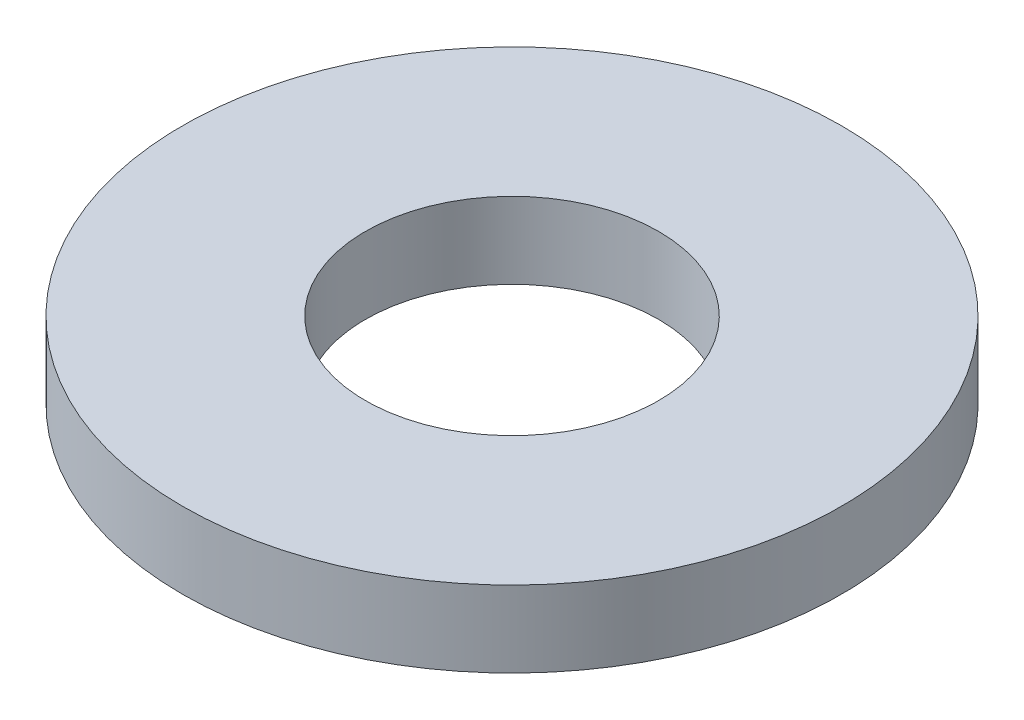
ISO-10303-21;
HEADER;
FILE_DESCRIPTION(('STEP AP214'),'2;1');
FILE_NAME('part.step','',(''),(''),'','','');
FILE_SCHEMA(('AUTOMOTIVE_DESIGN { 1 0 10303 214 1 1 1 1 }'));
ENDSEC;
DATA;
#1=APPLICATION_CONTEXT('core data for automotive mechanical design processes');
#2=APPLICATION_PROTOCOL_DEFINITION('international standard','automotive_design',2000,#1);
#3=PRODUCT_CONTEXT('',#1,'mechanical');
#4=PRODUCT('Part','Part','',(#3));
#5=PRODUCT_RELATED_PRODUCT_CATEGORY('part','',(#4));
#6=PRODUCT_DEFINITION_FORMATION('','',#4);
#7=PRODUCT_DEFINITION_CONTEXT('part definition',#1,'design');
#8=PRODUCT_DEFINITION('design','',#6,#7);
#9=PRODUCT_DEFINITION_SHAPE('','',#8);
#10=(LENGTH_UNIT() NAMED_UNIT(*) SI_UNIT(.MILLI.,.METRE.));
#11=(NAMED_UNIT(*) PLANE_ANGLE_UNIT() SI_UNIT($,.RADIAN.));
#12=(NAMED_UNIT(*) SI_UNIT($,.STERADIAN.) SOLID_ANGLE_UNIT());
#13=UNCERTAINTY_MEASURE_WITH_UNIT(LENGTH_MEASURE(1.E-05),#10,'distance_accuracy_value','');
#14=(GEOMETRIC_REPRESENTATION_CONTEXT(3) GLOBAL_UNCERTAINTY_ASSIGNED_CONTEXT((#13)) GLOBAL_UNIT_ASSIGNED_CONTEXT((#10,
#11,#12)) REPRESENTATION_CONTEXT('',''));
#15=CARTESIAN_POINT('',(0.,0.,0.));
#16=DIRECTION('',(0.,0.,1.));
#17=DIRECTION('',(1.,0.,0.));
#18=AXIS2_PLACEMENT_3D('',#15,#16,#17);
#19=CARTESIAN_POINT('',(0.,1.651,0.));
#20=DIRECTION('',(0.,1.,0.));
#21=DIRECTION('',(0.,0.,1.));
#22=AXIS2_PLACEMENT_3D('',#19,#20,#21);
#23=PLANE('',#22);
#24=CARTESIAN_POINT('',(0.,1.651,0.));
#25=DIRECTION('',(0.,1.,0.));
#26=DIRECTION('',(0.,0.,1.));
#27=AXIS2_PLACEMENT_3D('',#24,#25,#26);
#28=CIRCLE('',#27,7.1374);
#29=CARTESIAN_POINT('',(0.,1.651,-7.1374));
#30=VERTEX_POINT('',#29);
#31=EDGE_CURVE('E10',#30,#30,#28,.T.);
#32=ORIENTED_EDGE('',*,*,#31,.T.);
#33=EDGE_LOOP('',(#32));
#34=FACE_BOUND('',#33,.T.);
#35=CARTESIAN_POINT('',(0.,1.651,0.));
#36=DIRECTION('',(0.,1.,0.));
#37=DIRECTION('',(0.,0.,1.));
#38=AXIS2_PLACEMENT_3D('',#35,#36,#37);
#39=CIRCLE('',#38,3.175);
#40=CARTESIAN_POINT('',(0.,1.651,-3.175));
#41=VERTEX_POINT('',#40);
#42=EDGE_CURVE('E46',#41,#41,#39,.T.);
#43=ORIENTED_EDGE('',*,*,#42,.F.);
#44=EDGE_LOOP('',(#43));
#45=FACE_BOUND('',#44,.T.);
#46=ADVANCED_FACE('F33',(#34,#45),#23,.T.);
#47=CARTESIAN_POINT('',(0.,0.,0.));
#48=DIRECTION('',(0.,1.,0.));
#49=DIRECTION('',(0.,0.,1.));
#50=AXIS2_PLACEMENT_3D('',#47,#48,#49);
#51=PLANE('',#50);
#52=CARTESIAN_POINT('',(0.,0.,0.));
#53=DIRECTION('',(0.,1.,0.));
#54=DIRECTION('',(0.,0.,1.));
#55=AXIS2_PLACEMENT_3D('',#52,#53,#54);
#56=CIRCLE('',#55,7.1374);
#57=CARTESIAN_POINT('',(0.,0.,-7.1374));
#58=VERTEX_POINT('',#57);
#59=EDGE_CURVE('E37',#58,#58,#56,.T.);
#60=ORIENTED_EDGE('',*,*,#59,.F.);
#61=EDGE_LOOP('',(#60));
#62=FACE_BOUND('',#61,.T.);
#63=CARTESIAN_POINT('',(0.,0.,0.));
#64=DIRECTION('',(0.,1.,0.));
#65=DIRECTION('',(0.,0.,1.));
#66=AXIS2_PLACEMENT_3D('',#63,#64,#65);
#67=CIRCLE('',#66,3.175);
#68=CARTESIAN_POINT('',(0.,0.,-3.175));
#69=VERTEX_POINT('',#68);
#70=EDGE_CURVE('E48',#69,#69,#67,.T.);
#71=ORIENTED_EDGE('',*,*,#70,.T.);
#72=EDGE_LOOP('',(#71));
#73=FACE_BOUND('',#72,.T.);
#74=ADVANCED_FACE('F58',(#62,#73),#51,.F.);
#75=CARTESIAN_POINT('',(0.,1.651,0.));
#76=DIRECTION('',(0.,-1.,0.));
#77=DIRECTION('',(0.,0.,-1.));
#78=AXIS2_PLACEMENT_3D('',#75,#76,#77);
#79=CYLINDRICAL_SURFACE('',#78,7.1374);
#80=CARTESIAN_POINT('',(0.,1.651,-7.1374));
#81=CARTESIAN_POINT('',(0.,1.63380208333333,-7.1374));
#82=CARTESIAN_POINT('',(0.,1.61660416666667,-7.1374));
#83=CARTESIAN_POINT('',(0.,1.58220833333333,-7.1374));
#84=CARTESIAN_POINT('',(0.,1.56501041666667,-7.1374));
#85=CARTESIAN_POINT('',(0.,1.53061458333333,-7.1374));
#86=CARTESIAN_POINT('',(0.,1.51341666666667,-7.1374));
#87=CARTESIAN_POINT('',(0.,1.47902083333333,-7.1374));
#88=CARTESIAN_POINT('',(0.,1.46182291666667,-7.1374));
#89=CARTESIAN_POINT('',(0.,1.42742708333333,-7.1374));
#90=CARTESIAN_POINT('',(0.,1.41022916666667,-7.1374));
#91=CARTESIAN_POINT('',(0.,1.37583333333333,-7.1374));
#92=CARTESIAN_POINT('',(0.,1.35863541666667,-7.1374));
#93=CARTESIAN_POINT('',(0.,1.32423958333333,-7.1374));
#94=CARTESIAN_POINT('',(0.,1.30704166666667,-7.1374));
#95=CARTESIAN_POINT('',(0.,1.27264583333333,-7.1374));
#96=CARTESIAN_POINT('',(0.,1.25544791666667,-7.1374));
#97=CARTESIAN_POINT('',(0.,1.22105208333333,-7.1374));
#98=CARTESIAN_POINT('',(0.,1.20385416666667,-7.1374));
#99=CARTESIAN_POINT('',(0.,1.16945833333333,-7.1374));
#100=CARTESIAN_POINT('',(0.,1.15226041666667,-7.1374));
#101=CARTESIAN_POINT('',(0.,1.11786458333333,-7.1374));
#102=CARTESIAN_POINT('',(0.,1.10066666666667,-7.1374));
#103=CARTESIAN_POINT('',(0.,1.06627083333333,-7.1374));
#104=CARTESIAN_POINT('',(0.,1.04907291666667,-7.1374));
#105=CARTESIAN_POINT('',(0.,1.01467708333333,-7.1374));
#106=CARTESIAN_POINT('',(0.,0.997479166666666,-7.1374));
#107=CARTESIAN_POINT('',(0.,0.963083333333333,-7.1374));
#108=CARTESIAN_POINT('',(0.,0.945885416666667,-7.1374));
#109=CARTESIAN_POINT('',(0.,0.911489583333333,-7.1374));
#110=CARTESIAN_POINT('',(0.,0.894291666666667,-7.1374));
#111=CARTESIAN_POINT('',(0.,0.859895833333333,-7.1374));
#112=CARTESIAN_POINT('',(0.,0.842697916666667,-7.1374));
#113=CARTESIAN_POINT('',(0.,0.808302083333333,-7.1374));
#114=CARTESIAN_POINT('',(0.,0.791104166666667,-7.1374));
#115=CARTESIAN_POINT('',(0.,0.756708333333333,-7.1374));
#116=CARTESIAN_POINT('',(0.,0.739510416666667,-7.1374));
#117=CARTESIAN_POINT('',(0.,0.705114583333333,-7.1374));
#118=CARTESIAN_POINT('',(0.,0.687916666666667,-7.1374));
#119=CARTESIAN_POINT('',(0.,0.653520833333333,-7.1374));
#120=CARTESIAN_POINT('',(0.,0.636322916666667,-7.1374));
#121=CARTESIAN_POINT('',(0.,0.601927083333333,-7.1374));
#122=CARTESIAN_POINT('',(0.,0.584729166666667,-7.1374));
#123=CARTESIAN_POINT('',(0.,0.550333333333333,-7.1374));
#124=CARTESIAN_POINT('',(0.,0.533135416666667,-7.1374));
#125=CARTESIAN_POINT('',(0.,0.498739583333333,-7.1374));
#126=CARTESIAN_POINT('',(0.,0.481541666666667,-7.1374));
#127=CARTESIAN_POINT('',(0.,0.447145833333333,-7.1374));
#128=CARTESIAN_POINT('',(0.,0.429947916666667,-7.1374));
#129=CARTESIAN_POINT('',(0.,0.395552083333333,-7.1374));
#130=CARTESIAN_POINT('',(0.,0.378354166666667,-7.1374));
#131=CARTESIAN_POINT('',(0.,0.343958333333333,-7.1374));
#132=CARTESIAN_POINT('',(0.,0.326760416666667,-7.1374));
#133=CARTESIAN_POINT('',(0.,0.292364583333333,-7.1374));
#134=CARTESIAN_POINT('',(0.,0.275166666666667,-7.1374));
#135=CARTESIAN_POINT('',(0.,0.240770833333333,-7.1374));
#136=CARTESIAN_POINT('',(0.,0.223572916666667,-7.1374));
#137=CARTESIAN_POINT('',(0.,0.189177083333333,-7.1374));
#138=CARTESIAN_POINT('',(0.,0.171979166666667,-7.1374));
#139=CARTESIAN_POINT('',(0.,0.137583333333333,-7.1374));
#140=CARTESIAN_POINT('',(0.,0.120385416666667,-7.1374));
#141=CARTESIAN_POINT('',(0.,0.0859895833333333,-7.1374));
#142=CARTESIAN_POINT('',(0.,0.0687916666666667,-7.1374));
#143=CARTESIAN_POINT('',(0.,0.0343958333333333,-7.1374));
#144=CARTESIAN_POINT('',(0.,0.0171979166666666,-7.1374));
#145=CARTESIAN_POINT('',(0.,0.,-7.1374));
#146=B_SPLINE_CURVE_WITH_KNOTS('',3,(#80,#81,#82,#83,#84,#85,#86,#87,#88,#89,#90,#91,#92,#93,
#94,#95,#96,#97,#98,#99,#100,#101,#102,#103,#104,#105,#106,#107,#108,#109,#110,#111,#112,#113,
#114,#115,#116,#117,#118,#119,#120,#121,#122,#123,#124,#125,#126,#127,#128,#129,#130,#131,#132,
#133,#134,#135,#136,#137,#138,#139,#140,#141,#142,#143,#144,#145),.UNSPECIFIED.,.F.,.F.,(4,2,2,
2,2,2,2,2,2,2,2,2,2,2,2,2,2,2,2,2,2,2,2,2,2,2,2,2,2,2,2,2,4),(0.,0.05159375,0.1031875,
0.15478125,0.206375,0.25796875,0.3095625,0.36115625,0.41275,0.46434375,0.5159375,0.56753125,
0.619125,0.67071875,0.7223125,0.77390625,0.8255,0.87709375,0.9286875,0.98028125,1.031875,
1.08346875,1.1350625,1.18665625,1.23825,1.28984375,1.3414375,1.39303125,1.444625,1.49621875,
1.5478125,1.59940625,1.651),.UNSPECIFIED.);
#147=EDGE_CURVE('BSEAM35',#30,#58,#146,.T.);
#148=ORIENTED_EDGE('',*,*,#31,.F.);
#149=ORIENTED_EDGE('',*,*,#59,.T.);
#150=ORIENTED_EDGE('',*,*,#147,.T.);
#151=ORIENTED_EDGE('',*,*,#147,.F.);
#152=EDGE_LOOP('',(#148,#150,#149,#151));
#153=FACE_BOUND('',#152,.T.);
#154=ADVANCED_FACE('F35',(#153),#79,.T.);
#155=CARTESIAN_POINT('',(0.,1.651,0.));
#156=DIRECTION('',(0.,-1.,0.));
#157=DIRECTION('',(0.,0.,-1.));
#158=AXIS2_PLACEMENT_3D('',#155,#156,#157);
#159=CYLINDRICAL_SURFACE('',#158,3.175);
#160=CARTESIAN_POINT('',(0.,1.651,-3.175));
#161=CARTESIAN_POINT('',(0.,1.63380208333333,-3.175));
#162=CARTESIAN_POINT('',(0.,1.61660416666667,-3.175));
#163=CARTESIAN_POINT('',(0.,1.58220833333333,-3.175));
#164=CARTESIAN_POINT('',(0.,1.56501041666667,-3.175));
#165=CARTESIAN_POINT('',(0.,1.53061458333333,-3.175));
#166=CARTESIAN_POINT('',(0.,1.51341666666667,-3.175));
#167=CARTESIAN_POINT('',(0.,1.47902083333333,-3.175));
#168=CARTESIAN_POINT('',(0.,1.46182291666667,-3.175));
#169=CARTESIAN_POINT('',(0.,1.42742708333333,-3.175));
#170=CARTESIAN_POINT('',(0.,1.41022916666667,-3.175));
#171=CARTESIAN_POINT('',(0.,1.37583333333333,-3.175));
#172=CARTESIAN_POINT('',(0.,1.35863541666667,-3.175));
#173=CARTESIAN_POINT('',(0.,1.32423958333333,-3.175));
#174=CARTESIAN_POINT('',(0.,1.30704166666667,-3.175));
#175=CARTESIAN_POINT('',(0.,1.27264583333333,-3.175));
#176=CARTESIAN_POINT('',(0.,1.25544791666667,-3.175));
#177=CARTESIAN_POINT('',(0.,1.22105208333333,-3.175));
#178=CARTESIAN_POINT('',(0.,1.20385416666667,-3.175));
#179=CARTESIAN_POINT('',(0.,1.16945833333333,-3.175));
#180=CARTESIAN_POINT('',(0.,1.15226041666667,-3.175));
#181=CARTESIAN_POINT('',(0.,1.11786458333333,-3.175));
#182=CARTESIAN_POINT('',(0.,1.10066666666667,-3.175));
#183=CARTESIAN_POINT('',(0.,1.06627083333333,-3.175));
#184=CARTESIAN_POINT('',(0.,1.04907291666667,-3.175));
#185=CARTESIAN_POINT('',(0.,1.01467708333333,-3.175));
#186=CARTESIAN_POINT('',(0.,0.997479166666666,-3.175));
#187=CARTESIAN_POINT('',(0.,0.963083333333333,-3.175));
#188=CARTESIAN_POINT('',(0.,0.945885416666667,-3.175));
#189=CARTESIAN_POINT('',(0.,0.911489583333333,-3.175));
#190=CARTESIAN_POINT('',(0.,0.894291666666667,-3.175));
#191=CARTESIAN_POINT('',(0.,0.859895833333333,-3.175));
#192=CARTESIAN_POINT('',(0.,0.842697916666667,-3.175));
#193=CARTESIAN_POINT('',(0.,0.808302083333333,-3.175));
#194=CARTESIAN_POINT('',(0.,0.791104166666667,-3.175));
#195=CARTESIAN_POINT('',(0.,0.756708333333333,-3.175));
#196=CARTESIAN_POINT('',(0.,0.739510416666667,-3.175));
#197=CARTESIAN_POINT('',(0.,0.705114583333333,-3.175));
#198=CARTESIAN_POINT('',(0.,0.687916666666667,-3.175));
#199=CARTESIAN_POINT('',(0.,0.653520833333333,-3.175));
#200=CARTESIAN_POINT('',(0.,0.636322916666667,-3.175));
#201=CARTESIAN_POINT('',(0.,0.601927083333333,-3.175));
#202=CARTESIAN_POINT('',(0.,0.584729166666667,-3.175));
#203=CARTESIAN_POINT('',(0.,0.550333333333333,-3.175));
#204=CARTESIAN_POINT('',(0.,0.533135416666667,-3.175));
#205=CARTESIAN_POINT('',(0.,0.498739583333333,-3.175));
#206=CARTESIAN_POINT('',(0.,0.481541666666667,-3.175));
#207=CARTESIAN_POINT('',(0.,0.447145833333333,-3.175));
#208=CARTESIAN_POINT('',(0.,0.429947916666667,-3.175));
#209=CARTESIAN_POINT('',(0.,0.395552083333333,-3.175));
#210=CARTESIAN_POINT('',(0.,0.378354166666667,-3.175));
#211=CARTESIAN_POINT('',(0.,0.343958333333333,-3.175));
#212=CARTESIAN_POINT('',(0.,0.326760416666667,-3.175));
#213=CARTESIAN_POINT('',(0.,0.292364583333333,-3.175));
#214=CARTESIAN_POINT('',(0.,0.275166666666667,-3.175));
#215=CARTESIAN_POINT('',(0.,0.240770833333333,-3.175));
#216=CARTESIAN_POINT('',(0.,0.223572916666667,-3.175));
#217=CARTESIAN_POINT('',(0.,0.189177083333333,-3.175));
#218=CARTESIAN_POINT('',(0.,0.171979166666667,-3.175));
#219=CARTESIAN_POINT('',(0.,0.137583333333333,-3.175));
#220=CARTESIAN_POINT('',(0.,0.120385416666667,-3.175));
#221=CARTESIAN_POINT('',(0.,0.0859895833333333,-3.175));
#222=CARTESIAN_POINT('',(0.,0.0687916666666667,-3.175));
#223=CARTESIAN_POINT('',(0.,0.0343958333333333,-3.175));
#224=CARTESIAN_POINT('',(0.,0.0171979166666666,-3.175));
#225=CARTESIAN_POINT('',(0.,0.,-3.175));
#226=B_SPLINE_CURVE_WITH_KNOTS('',3,(#160,#161,#162,#163,#164,#165,#166,#167,#168,#169,#170,
#171,#172,#173,#174,#175,#176,#177,#178,#179,#180,#181,#182,#183,#184,#185,#186,#187,#188,#189,
#190,#191,#192,#193,#194,#195,#196,#197,#198,#199,#200,#201,#202,#203,#204,#205,#206,#207,#208,
#209,#210,#211,#212,#213,#214,#215,#216,#217,#218,#219,#220,#221,#222,#223,#224,#225),
.UNSPECIFIED.,.F.,.F.,(4,2,2,2,2,2,2,2,2,2,2,2,2,2,2,2,2,2,2,2,2,2,2,2,2,2,2,2,2,2,2,2,4),(0.,
0.05159375,0.1031875,0.15478125,0.206375,0.25796875,0.3095625,0.36115625,0.41275,0.46434375,
0.5159375,0.56753125,0.619125,0.67071875,0.7223125,0.77390625,0.8255,0.87709375,0.9286875,
0.98028125,1.031875,1.08346875,1.1350625,1.18665625,1.23825,1.28984375,1.3414375,1.39303125,
1.444625,1.49621875,1.5478125,1.59940625,1.651),.UNSPECIFIED.);
#227=EDGE_CURVE('BSEAM54',#41,#69,#226,.T.);
#228=ORIENTED_EDGE('',*,*,#42,.T.);
#229=ORIENTED_EDGE('',*,*,#70,.F.);
#230=ORIENTED_EDGE('',*,*,#227,.T.);
#231=ORIENTED_EDGE('',*,*,#227,.F.);
#232=EDGE_LOOP('',(#228,#230,#229,#231));
#233=FACE_BOUND('',#232,.T.);
#234=ADVANCED_FACE('F54',(#233),#159,.F.);
#235=CLOSED_SHELL('',(#46,#74,#154,#234));
#236=MANIFOLD_SOLID_BREP('B2',#235);
#237=ADVANCED_BREP_SHAPE_REPRESENTATION('',(#18,#236),#14);
#238=SHAPE_DEFINITION_REPRESENTATION(#9,#237);
ENDSEC;
END-ISO-10303-21;
